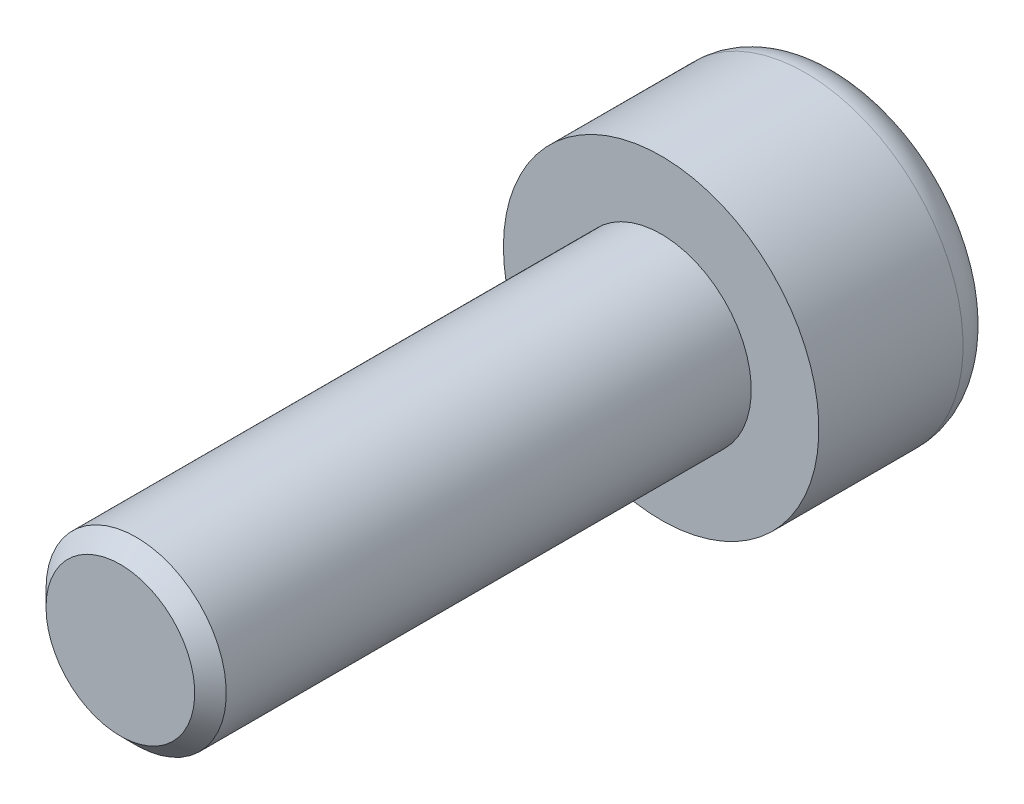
ISO-10303-21;
HEADER;
FILE_DESCRIPTION(('STEP AP214'),'2;1');
FILE_NAME('part.step','',(''),(''),'','','');
FILE_SCHEMA(('AUTOMOTIVE_DESIGN { 1 0 10303 214 1 1 1 1 }'));
ENDSEC;
DATA;
#1=APPLICATION_CONTEXT('core data for automotive mechanical design processes');
#2=APPLICATION_PROTOCOL_DEFINITION('international standard','automotive_design',2000,#1);
#3=PRODUCT_CONTEXT('',#1,'mechanical');
#4=PRODUCT('Part','Part','',(#3));
#5=PRODUCT_RELATED_PRODUCT_CATEGORY('part','',(#4));
#6=PRODUCT_DEFINITION_FORMATION('','',#4);
#7=PRODUCT_DEFINITION_CONTEXT('part definition',#1,'design');
#8=PRODUCT_DEFINITION('design','',#6,#7);
#9=PRODUCT_DEFINITION_SHAPE('','',#8);
#10=(LENGTH_UNIT() NAMED_UNIT(*) SI_UNIT(.MILLI.,.METRE.));
#11=(NAMED_UNIT(*) PLANE_ANGLE_UNIT() SI_UNIT($,.RADIAN.));
#12=(NAMED_UNIT(*) SI_UNIT($,.STERADIAN.) SOLID_ANGLE_UNIT());
#13=UNCERTAINTY_MEASURE_WITH_UNIT(LENGTH_MEASURE(1.E-05),#10,'distance_accuracy_value','');
#14=(GEOMETRIC_REPRESENTATION_CONTEXT(3) GLOBAL_UNCERTAINTY_ASSIGNED_CONTEXT((#13)) GLOBAL_UNIT_ASSIGNED_CONTEXT((#10,
#11,#12)) REPRESENTATION_CONTEXT('',''));
#15=CARTESIAN_POINT('',(0.,0.,0.));
#16=DIRECTION('',(0.,0.,1.));
#17=DIRECTION('',(1.,0.,0.));
#18=AXIS2_PLACEMENT_3D('',#15,#16,#17);
#19=CARTESIAN_POINT('',(-1.5,-0.866025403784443,2.5));
#20=DIRECTION('',(-0.500000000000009,-0.866025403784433,0.));
#21=DIRECTION('',(0.866025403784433,-0.500000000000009,0.));
#22=AXIS2_PLACEMENT_3D('',#19,#20,#21);
#23=PLANE('',#22);
#24=DIRECTION('',(0.,0.,1.));
#25=VECTOR('',#24,1.);
#26=CARTESIAN_POINT('',(-1.5,-0.866025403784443,2.5));
#27=LINE('',#26,#25);
#28=CARTESIAN_POINT('',(-1.5,-0.866025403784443,0.));
#29=VERTEX_POINT('',#28);
#30=CARTESIAN_POINT('',(-1.5,-0.866025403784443,2.5));
#31=VERTEX_POINT('',#30);
#32=EDGE_CURVE('E87',#29,#31,#27,.T.);
#33=ORIENTED_EDGE('',*,*,#32,.T.);
#34=DIRECTION('',(0.866025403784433,-0.500000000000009,0.));
#35=VECTOR('',#34,1.);
#36=CARTESIAN_POINT('',(-1.5,-0.866025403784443,2.5));
#37=LINE('',#36,#35);
#38=CARTESIAN_POINT('',(0.,-1.7320508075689,2.5));
#39=VERTEX_POINT('',#38);
#40=EDGE_CURVE('E76',#39,#31,#37,.F.);
#41=ORIENTED_EDGE('',*,*,#40,.F.);
#42=DIRECTION('',(0.,0.,1.));
#43=VECTOR('',#42,1.);
#44=CARTESIAN_POINT('',(0.,-1.7320508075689,2.5));
#45=LINE('',#44,#43);
#46=CARTESIAN_POINT('',(0.,-1.7320508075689,0.));
#47=VERTEX_POINT('',#46);
#48=EDGE_CURVE('E96',#39,#47,#45,.F.);
#49=ORIENTED_EDGE('',*,*,#48,.T.);
#50=DIRECTION('',(0.866025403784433,-0.500000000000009,0.));
#51=VECTOR('',#50,1.);
#52=CARTESIAN_POINT('',(-1.5,-0.866025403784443,0.));
#53=LINE('',#52,#51);
#54=EDGE_CURVE('E71',#29,#47,#53,.T.);
#55=ORIENTED_EDGE('',*,*,#54,.F.);
#56=EDGE_LOOP('',(#33,#41,#49,#55));
#57=FACE_BOUND('',#56,.T.);
#58=ADVANCED_FACE('F16',(#57),#23,.F.);
#59=CARTESIAN_POINT('',(-1.5,0.866025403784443,2.5));
#60=DIRECTION('',(-1.,0.,0.));
#61=DIRECTION('',(0.,0.,1.));
#62=AXIS2_PLACEMENT_3D('',#59,#60,#61);
#63=PLANE('',#62);
#64=DIRECTION('',(0.,0.,1.));
#65=VECTOR('',#64,1.);
#66=CARTESIAN_POINT('',(-1.5,0.866025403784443,2.5));
#67=LINE('',#66,#65);
#68=CARTESIAN_POINT('',(-1.5,0.866025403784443,0.));
#69=VERTEX_POINT('',#68);
#70=CARTESIAN_POINT('',(-1.5,0.866025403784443,2.5));
#71=VERTEX_POINT('',#70);
#72=EDGE_CURVE('E92',#69,#71,#67,.T.);
#73=ORIENTED_EDGE('',*,*,#72,.T.);
#74=DIRECTION('',(0.,1.,0.));
#75=VECTOR('',#74,1.);
#76=CARTESIAN_POINT('',(-1.5,0.866025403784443,2.5));
#77=LINE('',#76,#75);
#78=EDGE_CURVE('E80',#31,#71,#77,.T.);
#79=ORIENTED_EDGE('',*,*,#78,.F.);
#80=ORIENTED_EDGE('',*,*,#32,.F.);
#81=DIRECTION('',(0.,1.,0.));
#82=VECTOR('',#81,1.);
#83=CARTESIAN_POINT('',(-1.5,0.866025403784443,0.));
#84=LINE('',#83,#82);
#85=EDGE_CURVE('E94',#69,#29,#84,.F.);
#86=ORIENTED_EDGE('',*,*,#85,.F.);
#87=EDGE_LOOP('',(#73,#79,#80,#86));
#88=FACE_BOUND('',#87,.T.);
#89=ADVANCED_FACE('F90',(#88),#63,.F.);
#90=CARTESIAN_POINT('',(1.5,-0.866025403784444,2.5));
#91=DIRECTION('',(0.500000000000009,-0.866025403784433,0.));
#92=DIRECTION('',(0.866025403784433,0.500000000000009,0.));
#93=AXIS2_PLACEMENT_3D('',#90,#91,#92);
#94=PLANE('',#93);
#95=ORIENTED_EDGE('',*,*,#48,.F.);
#96=DIRECTION('',(0.866025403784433,0.500000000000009,0.));
#97=VECTOR('',#96,1.);
#98=CARTESIAN_POINT('',(0.,-1.7320508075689,2.5));
#99=LINE('',#98,#97);
#100=CARTESIAN_POINT('',(1.5,-0.866025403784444,2.5));
#101=VERTEX_POINT('',#100);
#102=EDGE_CURVE('E83',#39,#101,#99,.T.);
#103=ORIENTED_EDGE('',*,*,#102,.T.);
#104=DIRECTION('',(0.,0.,-1.));
#105=VECTOR('',#104,1.);
#106=CARTESIAN_POINT('',(1.5,-0.866025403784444,2.5));
#107=LINE('',#106,#105);
#108=CARTESIAN_POINT('',(1.5,-0.866025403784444,0.));
#109=VERTEX_POINT('',#108);
#110=EDGE_CURVE('E292',#101,#109,#107,.T.);
#111=ORIENTED_EDGE('',*,*,#110,.T.);
#112=DIRECTION('',(0.866025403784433,0.500000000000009,0.));
#113=VECTOR('',#112,1.);
#114=CARTESIAN_POINT('',(1.5,-0.866025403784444,0.));
#115=LINE('',#114,#113);
#116=EDGE_CURVE('E281',#47,#109,#115,.T.);
#117=ORIENTED_EDGE('',*,*,#116,.F.);
#118=EDGE_LOOP('',(#95,#103,#111,#117));
#119=FACE_BOUND('',#118,.T.);
#120=ADVANCED_FACE('F244',(#119),#94,.F.);
#121=CARTESIAN_POINT('',(0.,1.7320508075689,2.5));
#122=DIRECTION('',(-0.500000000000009,0.866025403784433,0.));
#123=DIRECTION('',(-0.866025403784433,-0.500000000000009,0.));
#124=AXIS2_PLACEMENT_3D('',#121,#122,#123);
#125=PLANE('',#124);
#126=DIRECTION('',(0.,0.,1.));
#127=VECTOR('',#126,1.);
#128=CARTESIAN_POINT('',(0.,1.7320508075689,2.5));
#129=LINE('',#128,#127);
#130=CARTESIAN_POINT('',(0.,1.7320508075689,0.));
#131=VERTEX_POINT('',#130);
#132=CARTESIAN_POINT('',(0.,1.7320508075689,2.5));
#133=VERTEX_POINT('',#132);
#134=EDGE_CURVE('E297',#131,#133,#129,.T.);
#135=ORIENTED_EDGE('',*,*,#134,.T.);
#136=DIRECTION('',(-0.866025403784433,-0.500000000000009,0.));
#137=VECTOR('',#136,1.);
#138=CARTESIAN_POINT('',(0.,1.7320508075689,2.5));
#139=LINE('',#138,#137);
#140=EDGE_CURVE('E288',#133,#71,#139,.T.);
#141=ORIENTED_EDGE('',*,*,#140,.T.);
#142=ORIENTED_EDGE('',*,*,#72,.F.);
#143=DIRECTION('',(-0.866025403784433,-0.500000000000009,0.));
#144=VECTOR('',#143,1.);
#145=CARTESIAN_POINT('',(0.,1.7320508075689,0.));
#146=LINE('',#145,#144);
#147=EDGE_CURVE('E285',#131,#69,#146,.T.);
#148=ORIENTED_EDGE('',*,*,#147,.F.);
#149=EDGE_LOOP('',(#135,#141,#142,#148));
#150=FACE_BOUND('',#149,.T.);
#151=ADVANCED_FACE('F235',(#150),#125,.F.);
#152=CARTESIAN_POINT('',(-2.99999999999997,0.,2.5));
#153=DIRECTION('',(0.,0.,1.));
#154=DIRECTION('',(1.,0.,0.));
#155=AXIS2_PLACEMENT_3D('',#152,#153,#154);
#156=PLANE('',#155);
#157=DIRECTION('',(-0.866025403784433,0.500000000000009,0.));
#158=VECTOR('',#157,1.);
#159=CARTESIAN_POINT('',(0.,1.7320508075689,2.5));
#160=LINE('',#159,#158);
#161=CARTESIAN_POINT('',(1.5,0.866025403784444,2.5));
#162=VERTEX_POINT('',#161);
#163=EDGE_CURVE('E120',#133,#162,#160,.F.);
#164=ORIENTED_EDGE('',*,*,#163,.T.);
#165=DIRECTION('',(0.,1.,0.));
#166=VECTOR('',#165,1.);
#167=CARTESIAN_POINT('',(1.5,0.866025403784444,2.5));
#168=LINE('',#167,#166);
#169=EDGE_CURVE('E290',#162,#101,#168,.F.);
#170=ORIENTED_EDGE('',*,*,#169,.T.);
#171=ORIENTED_EDGE('',*,*,#102,.F.);
#172=ORIENTED_EDGE('',*,*,#40,.T.);
#173=ORIENTED_EDGE('',*,*,#78,.T.);
#174=ORIENTED_EDGE('',*,*,#140,.F.);
#175=EDGE_LOOP('',(#164,#170,#171,#172,#173,#174));
#176=FACE_BOUND('',#175,.T.);
#177=ADVANCED_FACE('F77',(#176),#156,.F.);
#178=CARTESIAN_POINT('',(1.5,0.866025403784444,2.5));
#179=DIRECTION('',(1.,0.,0.));
#180=DIRECTION('',(0.,0.,-1.));
#181=AXIS2_PLACEMENT_3D('',#178,#179,#180);
#182=PLANE('',#181);
#183=ORIENTED_EDGE('',*,*,#110,.F.);
#184=ORIENTED_EDGE('',*,*,#169,.F.);
#185=DIRECTION('',(0.,0.,1.));
#186=VECTOR('',#185,1.);
#187=CARTESIAN_POINT('',(1.5,0.866025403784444,2.5));
#188=LINE('',#187,#186);
#189=CARTESIAN_POINT('',(1.5,0.866025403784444,0.));
#190=VERTEX_POINT('',#189);
#191=EDGE_CURVE('E113',#162,#190,#188,.F.);
#192=ORIENTED_EDGE('',*,*,#191,.T.);
#193=DIRECTION('',(0.,1.,0.));
#194=VECTOR('',#193,1.);
#195=CARTESIAN_POINT('',(1.5,0.866025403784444,0.));
#196=LINE('',#195,#194);
#197=EDGE_CURVE('E294',#109,#190,#196,.T.);
#198=ORIENTED_EDGE('',*,*,#197,.F.);
#199=EDGE_LOOP('',(#183,#184,#192,#198));
#200=FACE_BOUND('',#199,.T.);
#201=ADVANCED_FACE('F165',(#200),#182,.F.);
#202=CARTESIAN_POINT('',(0.,1.7320508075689,2.5));
#203=DIRECTION('',(0.500000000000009,0.866025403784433,0.));
#204=DIRECTION('',(-0.866025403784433,0.500000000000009,0.));
#205=AXIS2_PLACEMENT_3D('',#202,#203,#204);
#206=PLANE('',#205);
#207=ORIENTED_EDGE('',*,*,#191,.F.);
#208=ORIENTED_EDGE('',*,*,#163,.F.);
#209=ORIENTED_EDGE('',*,*,#134,.F.);
#210=DIRECTION('',(0.866025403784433,-0.500000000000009,0.));
#211=VECTOR('',#210,1.);
#212=CARTESIAN_POINT('',(0.,1.7320508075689,0.));
#213=LINE('',#212,#211);
#214=EDGE_CURVE('E111',#131,#190,#213,.T.);
#215=ORIENTED_EDGE('',*,*,#214,.T.);
#216=EDGE_LOOP('',(#207,#208,#209,#215));
#217=FACE_BOUND('',#216,.T.);
#218=ADVANCED_FACE('F159',(#217),#206,.F.);
#219=CARTESIAN_POINT('',(0.,0.,0.));
#220=DIRECTION('',(0.,0.,1.));
#221=DIRECTION('',(1.,0.,0.));
#222=AXIS2_PLACEMENT_3D('',#219,#220,#221);
#223=PLANE('',#222);
#224=ORIENTED_EDGE('',*,*,#147,.T.);
#225=ORIENTED_EDGE('',*,*,#85,.T.);
#226=ORIENTED_EDGE('',*,*,#54,.T.);
#227=ORIENTED_EDGE('',*,*,#116,.T.);
#228=ORIENTED_EDGE('',*,*,#197,.T.);
#229=ORIENTED_EDGE('',*,*,#214,.F.);
#230=EDGE_LOOP('',(#224,#225,#226,#227,#228,#229));
#231=FACE_BOUND('',#230,.T.);
#232=CARTESIAN_POINT('',(0.,0.,0.));
#233=DIRECTION('',(0.,0.,1.));
#234=DIRECTION('',(1.,0.,0.));
#235=AXIS2_PLACEMENT_3D('',#232,#233,#234);
#236=CIRCLE('',#235,2.7);
#237=CARTESIAN_POINT('',(2.7,0.,0.));
#238=VERTEX_POINT('',#237);
#239=CARTESIAN_POINT('',(-2.7,0.,0.));
#240=VERTEX_POINT('',#239);
#241=EDGE_CURVE('E109',#238,#240,#236,.T.);
#242=ORIENTED_EDGE('',*,*,#241,.F.);
#243=CARTESIAN_POINT('',(0.,0.,0.));
#244=DIRECTION('',(0.,0.,1.));
#245=DIRECTION('',(-1.,0.,0.));
#246=AXIS2_PLACEMENT_3D('',#243,#244,#245);
#247=CIRCLE('',#246,2.7);
#248=EDGE_CURVE('E35',#240,#238,#247,.T.);
#249=ORIENTED_EDGE('',*,*,#248,.F.);
#250=EDGE_LOOP('',(#242,#249));
#251=FACE_BOUND('',#250,.T.);
#252=ADVANCED_FACE('F140',(#231,#251),#223,.F.);
#253=CARTESIAN_POINT('',(0.,0.,0.8));
#254=DIRECTION('',(0.,0.,1.));
#255=DIRECTION('',(1.,0.,0.));
#256=AXIS2_PLACEMENT_3D('',#253,#254,#255);
#257=TOROIDAL_SURFACE('',#256,2.7,0.8);
#258=CARTESIAN_POINT('',(0.,0.,0.8));
#259=DIRECTION('',(0.,0.,-1.));
#260=DIRECTION('',(-1.,0.,0.));
#261=AXIS2_PLACEMENT_3D('',#258,#259,#260);
#262=CIRCLE('',#261,3.5);
#263=CARTESIAN_POINT('',(-3.5,0.,0.8));
#264=VERTEX_POINT('',#263);
#265=EDGE_CURVE('E106',#264,#264,#262,.F.);
#266=ORIENTED_EDGE('',*,*,#265,.F.);
#267=EDGE_LOOP('',(#266));
#268=FACE_BOUND('',#267,.T.);
#269=ORIENTED_EDGE('',*,*,#241,.T.);
#270=ORIENTED_EDGE('',*,*,#248,.T.);
#271=EDGE_LOOP('',(#269,#270));
#272=FACE_BOUND('',#271,.T.);
#273=ADVANCED_FACE('F108',(#268,#272),#257,.T.);
#274=CARTESIAN_POINT('',(0.,0.,16.));
#275=DIRECTION('',(0.,0.,1.));
#276=DIRECTION('',(1.,0.,0.));
#277=AXIS2_PLACEMENT_3D('',#274,#275,#276);
#278=PLANE('',#277);
#279=CARTESIAN_POINT('',(0.,0.,16.0000000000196));
#280=DIRECTION('',(0.,0.,-1.));
#281=DIRECTION('',(-1.,0.,0.));
#282=AXIS2_PLACEMENT_3D('',#279,#280,#281);
#283=CIRCLE('',#282,1.65000000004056);
#284=CARTESIAN_POINT('',(-1.65000000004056,0.,16.0000000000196));
#285=VERTEX_POINT('',#284);
#286=EDGE_CURVE('E104',#285,#285,#283,.T.);
#287=ORIENTED_EDGE('',*,*,#286,.F.);
#288=EDGE_LOOP('',(#287));
#289=FACE_BOUND('',#288,.T.);
#290=ADVANCED_FACE('F139',(#289),#278,.T.);
#291=CARTESIAN_POINT('',(0.,0.,4.));
#292=DIRECTION('',(0.,0.,-1.));
#293=DIRECTION('',(-1.,0.,0.));
#294=AXIS2_PLACEMENT_3D('',#291,#292,#293);
#295=CYLINDRICAL_SURFACE('',#294,3.5);
#296=ORIENTED_EDGE('',*,*,#265,.T.);
#297=EDGE_LOOP('',(#296));
#298=FACE_BOUND('',#297,.T.);
#299=CARTESIAN_POINT('',(0.,0.,4.));
#300=DIRECTION('',(0.,0.,-1.));
#301=DIRECTION('',(-1.,0.,0.));
#302=AXIS2_PLACEMENT_3D('',#299,#300,#301);
#303=CIRCLE('',#302,3.5);
#304=CARTESIAN_POINT('',(-3.5,0.,4.));
#305=VERTEX_POINT('',#304);
#306=EDGE_CURVE('E101',#305,#305,#303,.F.);
#307=ORIENTED_EDGE('',*,*,#306,.F.);
#308=EDGE_LOOP('',(#307));
#309=FACE_BOUND('',#308,.T.);
#310=ADVANCED_FACE('F181',(#298,#309),#295,.T.);
#311=CARTESIAN_POINT('',(0.,0.,15.6499999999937));
#312=DIRECTION('',(0.,0.,-1.));
#313=DIRECTION('',(-1.,0.,0.));
#314=AXIS2_PLACEMENT_3D('',#311,#312,#313);
#315=CONICAL_SURFACE('',#314,2.00000000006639,0.785398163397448);
#316=CARTESIAN_POINT('',(0.,0.,15.65));
#317=DIRECTION('',(0.,0.,-1.));
#318=DIRECTION('',(-1.,0.,0.));
#319=AXIS2_PLACEMENT_3D('',#316,#317,#318);
#320=CIRCLE('',#319,2.);
#321=CARTESIAN_POINT('',(-2.,0.,15.65));
#322=VERTEX_POINT('',#321);
#323=EDGE_CURVE('E27',#322,#322,#320,.T.);
#324=ORIENTED_EDGE('',*,*,#323,.F.);
#325=EDGE_LOOP('',(#324));
#326=FACE_BOUND('',#325,.T.);
#327=ORIENTED_EDGE('',*,*,#286,.T.);
#328=EDGE_LOOP('',(#327));
#329=FACE_BOUND('',#328,.T.);
#330=ADVANCED_FACE('F175',(#326,#329),#315,.T.);
#331=CARTESIAN_POINT('',(0.,0.,4.));
#332=DIRECTION('',(0.,0.,1.));
#333=DIRECTION('',(1.,0.,0.));
#334=AXIS2_PLACEMENT_3D('',#331,#332,#333);
#335=PLANE('',#334);
#336=CARTESIAN_POINT('',(0.,0.,4.));
#337=DIRECTION('',(0.,0.,-1.));
#338=DIRECTION('',(-1.,0.,0.));
#339=AXIS2_PLACEMENT_3D('',#336,#337,#338);
#340=CIRCLE('',#339,2.);
#341=CARTESIAN_POINT('',(-2.,0.,4.));
#342=VERTEX_POINT('',#341);
#343=EDGE_CURVE('E11',#342,#342,#340,.F.);
#344=ORIENTED_EDGE('',*,*,#343,.F.);
#345=EDGE_LOOP('',(#344));
#346=FACE_BOUND('',#345,.T.);
#347=ORIENTED_EDGE('',*,*,#306,.T.);
#348=EDGE_LOOP('',(#347));
#349=FACE_BOUND('',#348,.T.);
#350=ADVANCED_FACE('F169',(#346,#349),#335,.T.);
#351=CARTESIAN_POINT('',(0.,0.,16.));
#352=DIRECTION('',(0.,0.,-1.));
#353=DIRECTION('',(-1.,0.,0.));
#354=AXIS2_PLACEMENT_3D('',#351,#352,#353);
#355=CYLINDRICAL_SURFACE('',#354,2.);
#356=ORIENTED_EDGE('',*,*,#343,.T.);
#357=EDGE_LOOP('',(#356));
#358=FACE_BOUND('',#357,.T.);
#359=ORIENTED_EDGE('',*,*,#323,.T.);
#360=EDGE_LOOP('',(#359));
#361=FACE_BOUND('',#360,.T.);
#362=ADVANCED_FACE('F167',(#358,#361),#355,.T.);
#363=CLOSED_SHELL('',(#58,#89,#120,#151,#177,#201,#218,#252,#273,#290,#310,#330,#350,#362));
#364=MANIFOLD_SOLID_BREP('B1',#363);
#365=ADVANCED_BREP_SHAPE_REPRESENTATION('',(#18,#364),#14);
#366=SHAPE_DEFINITION_REPRESENTATION(#9,#365);
ENDSEC;
END-ISO-10303-21;
